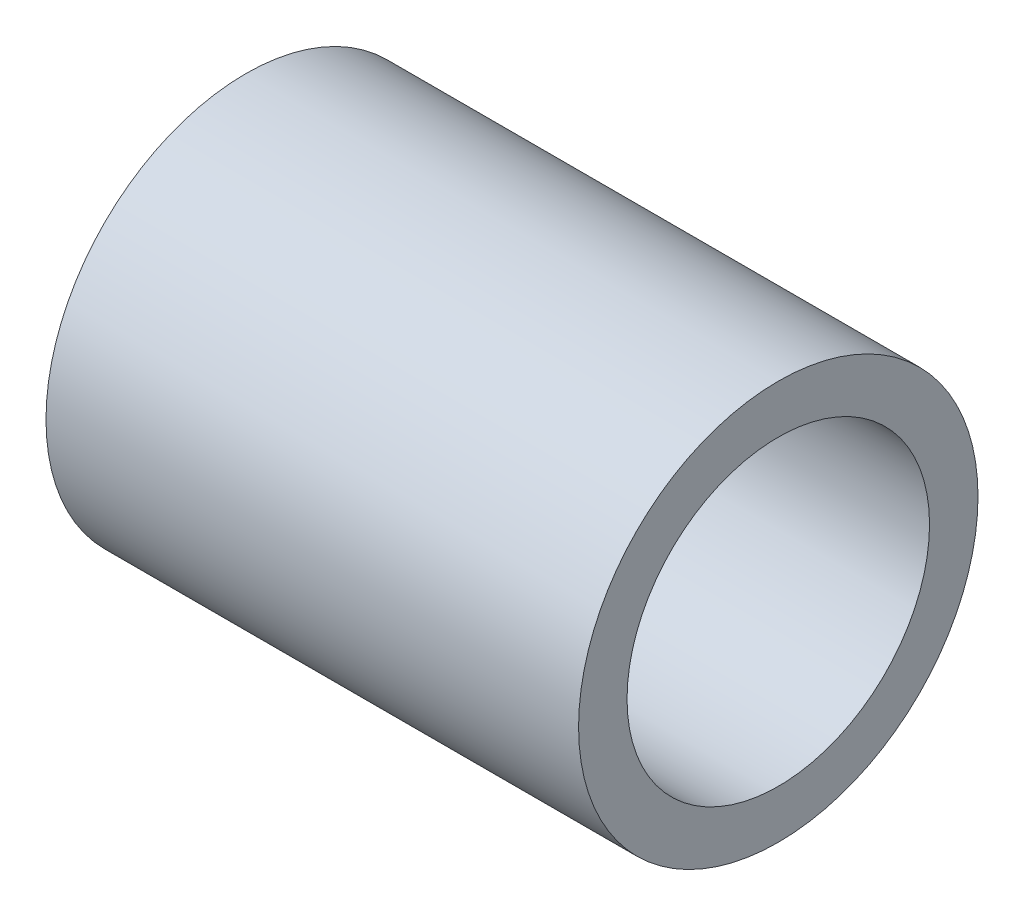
ISO-10303-21;
HEADER;
FILE_DESCRIPTION(('STEP AP214'),'2;1');
FILE_NAME('part.step','',(''),(''),'','','');
FILE_SCHEMA(('AUTOMOTIVE_DESIGN { 1 0 10303 214 1 1 1 1 }'));
ENDSEC;
DATA;
#1=APPLICATION_CONTEXT('core data for automotive mechanical design processes');
#2=APPLICATION_PROTOCOL_DEFINITION('international standard','automotive_design',2000,#1);
#3=PRODUCT_CONTEXT('',#1,'mechanical');
#4=PRODUCT('Part','Part','',(#3));
#5=PRODUCT_RELATED_PRODUCT_CATEGORY('part','',(#4));
#6=PRODUCT_DEFINITION_FORMATION('','',#4);
#7=PRODUCT_DEFINITION_CONTEXT('part definition',#1,'design');
#8=PRODUCT_DEFINITION('design','',#6,#7);
#9=PRODUCT_DEFINITION_SHAPE('','',#8);
#10=(LENGTH_UNIT() NAMED_UNIT(*) SI_UNIT(.MILLI.,.METRE.));
#11=(NAMED_UNIT(*) PLANE_ANGLE_UNIT() SI_UNIT($,.RADIAN.));
#12=(NAMED_UNIT(*) SI_UNIT($,.STERADIAN.) SOLID_ANGLE_UNIT());
#13=UNCERTAINTY_MEASURE_WITH_UNIT(LENGTH_MEASURE(1.E-05),#10,'distance_accuracy_value','');
#14=(GEOMETRIC_REPRESENTATION_CONTEXT(3) GLOBAL_UNCERTAINTY_ASSIGNED_CONTEXT((#13)) GLOBAL_UNIT_ASSIGNED_CONTEXT((#10,
#11,#12)) REPRESENTATION_CONTEXT('',''));
#15=CARTESIAN_POINT('',(0.,0.,0.));
#16=DIRECTION('',(0.,0.,1.));
#17=DIRECTION('',(1.,0.,0.));
#18=AXIS2_PLACEMENT_3D('',#15,#16,#17);
#19=CARTESIAN_POINT('',(22.225,0.,0.));
#20=DIRECTION('',(1.,0.,0.));
#21=DIRECTION('',(0.,0.,1.));
#22=AXIS2_PLACEMENT_3D('',#19,#20,#21);
#23=PLANE('',#22);
#24=CARTESIAN_POINT('',(22.225,0.,0.));
#25=DIRECTION('',(-1.,0.,0.));
#26=DIRECTION('',(0.,0.,1.));
#27=AXIS2_PLACEMENT_3D('',#24,#25,#26);
#28=CIRCLE('',#27,10.8204);
#29=CARTESIAN_POINT('',(22.225,0.,10.8204));
#30=VERTEX_POINT('',#29);
#31=EDGE_CURVE('E55',#30,#30,#28,.T.);
#32=ORIENTED_EDGE('',*,*,#31,.F.);
#33=EDGE_LOOP('',(#32));
#34=FACE_BOUND('',#33,.T.);
#35=CARTESIAN_POINT('',(22.225,0.,0.));
#36=DIRECTION('',(-1.,0.,0.));
#37=DIRECTION('',(0.,0.,1.));
#38=AXIS2_PLACEMENT_3D('',#35,#36,#37);
#39=CIRCLE('',#38,9.2456);
#40=CARTESIAN_POINT('',(22.225,0.,9.2456));
#41=VERTEX_POINT('',#40);
#42=EDGE_CURVE('E59',#41,#41,#39,.T.);
#43=ORIENTED_EDGE('',*,*,#42,.T.);
#44=EDGE_LOOP('',(#43));
#45=FACE_BOUND('',#44,.T.);
#46=ADVANCED_FACE('F32',(#34,#45),#23,.T.);
#47=CARTESIAN_POINT('',(38.1,0.,0.));
#48=DIRECTION('',(-1.,0.,0.));
#49=DIRECTION('',(0.,0.,-1.));
#50=AXIS2_PLACEMENT_3D('',#47,#48,#49);
#51=PLANE('',#50);
#52=CARTESIAN_POINT('',(38.1,0.,0.));
#53=DIRECTION('',(1.,0.,0.));
#54=DIRECTION('',(0.,0.,-1.));
#55=AXIS2_PLACEMENT_3D('',#52,#53,#54);
#56=CIRCLE('',#55,14.2875);
#57=CARTESIAN_POINT('',(38.1,0.,14.2875));
#58=VERTEX_POINT('',#57);
#59=EDGE_CURVE('E52',#58,#58,#56,.T.);
#60=ORIENTED_EDGE('',*,*,#59,.T.);
#61=EDGE_LOOP('',(#60));
#62=FACE_BOUND('',#61,.T.);
#63=CARTESIAN_POINT('',(38.1,0.,0.));
#64=DIRECTION('',(-1.,0.,0.));
#65=DIRECTION('',(0.,0.,1.));
#66=AXIS2_PLACEMENT_3D('',#63,#64,#65);
#67=CIRCLE('',#66,10.8204);
#68=CARTESIAN_POINT('',(38.1,0.,10.8204));
#69=VERTEX_POINT('',#68);
#70=EDGE_CURVE('E56',#69,#69,#67,.T.);
#71=ORIENTED_EDGE('',*,*,#70,.T.);
#72=EDGE_LOOP('',(#71));
#73=FACE_BOUND('',#72,.T.);
#74=ADVANCED_FACE('F83',(#62,#73),#51,.F.);
#75=CARTESIAN_POINT('',(19.05,0.,0.));
#76=DIRECTION('',(-1.,0.,0.));
#77=DIRECTION('',(0.,0.,1.));
#78=AXIS2_PLACEMENT_3D('',#75,#76,#77);
#79=CYLINDRICAL_SURFACE('',#78,14.2875);
#80=CARTESIAN_POINT('',(0.,0.,0.));
#81=DIRECTION('',(1.,0.,0.));
#82=DIRECTION('',(0.,0.,-1.));
#83=AXIS2_PLACEMENT_3D('',#80,#81,#82);
#84=CIRCLE('',#83,14.2875);
#85=CARTESIAN_POINT('',(0.,0.,14.2875));
#86=VERTEX_POINT('',#85);
#87=EDGE_CURVE('E10',#86,#86,#84,.T.);
#88=CARTESIAN_POINT('',(0.,0.,14.2875));
#89=CARTESIAN_POINT('',(0.396875,0.,14.2875));
#90=CARTESIAN_POINT('',(0.79375,0.,14.2875));
#91=CARTESIAN_POINT('',(1.5875,0.,14.2875));
#92=CARTESIAN_POINT('',(1.984375,0.,14.2875));
#93=CARTESIAN_POINT('',(2.778125,0.,14.2875));
#94=CARTESIAN_POINT('',(3.175,0.,14.2875));
#95=CARTESIAN_POINT('',(3.96875,0.,14.2875));
#96=CARTESIAN_POINT('',(4.365625,0.,14.2875));
#97=CARTESIAN_POINT('',(5.159375,0.,14.2875));
#98=CARTESIAN_POINT('',(5.55625,0.,14.2875));
#99=CARTESIAN_POINT('',(6.35,0.,14.2875));
#100=CARTESIAN_POINT('',(6.746875,0.,14.2875));
#101=CARTESIAN_POINT('',(7.540625,0.,14.2875));
#102=CARTESIAN_POINT('',(7.9375,0.,14.2875));
#103=CARTESIAN_POINT('',(8.73125,0.,14.2875));
#104=CARTESIAN_POINT('',(9.128125,0.,14.2875));
#105=CARTESIAN_POINT('',(9.921875,0.,14.2875));
#106=CARTESIAN_POINT('',(10.31875,0.,14.2875));
#107=CARTESIAN_POINT('',(11.1125,0.,14.2875));
#108=CARTESIAN_POINT('',(11.509375,0.,14.2875));
#109=CARTESIAN_POINT('',(12.303125,0.,14.2875));
#110=CARTESIAN_POINT('',(12.7,0.,14.2875));
#111=CARTESIAN_POINT('',(13.49375,0.,14.2875));
#112=CARTESIAN_POINT('',(13.890625,0.,14.2875));
#113=CARTESIAN_POINT('',(14.684375,0.,14.2875));
#114=CARTESIAN_POINT('',(15.08125,0.,14.2875));
#115=CARTESIAN_POINT('',(15.875,0.,14.2875));
#116=CARTESIAN_POINT('',(16.271875,0.,14.2875));
#117=CARTESIAN_POINT('',(17.065625,0.,14.2875));
#118=CARTESIAN_POINT('',(17.4625,0.,14.2875));
#119=CARTESIAN_POINT('',(18.25625,0.,14.2875));
#120=CARTESIAN_POINT('',(18.653125,0.,14.2875));
#121=CARTESIAN_POINT('',(19.446875,0.,14.2875));
#122=CARTESIAN_POINT('',(19.84375,0.,14.2875));
#123=CARTESIAN_POINT('',(20.6375,0.,14.2875));
#124=CARTESIAN_POINT('',(21.034375,0.,14.2875));
#125=CARTESIAN_POINT('',(21.828125,0.,14.2875));
#126=CARTESIAN_POINT('',(22.225,0.,14.2875));
#127=CARTESIAN_POINT('',(23.01875,0.,14.2875));
#128=CARTESIAN_POINT('',(23.415625,0.,14.2875));
#129=CARTESIAN_POINT('',(24.209375,0.,14.2875));
#130=CARTESIAN_POINT('',(24.60625,0.,14.2875));
#131=CARTESIAN_POINT('',(25.4,0.,14.2875));
#132=CARTESIAN_POINT('',(25.796875,0.,14.2875));
#133=CARTESIAN_POINT('',(26.590625,0.,14.2875));
#134=CARTESIAN_POINT('',(26.9875,0.,14.2875));
#135=CARTESIAN_POINT('',(27.78125,0.,14.2875));
#136=CARTESIAN_POINT('',(28.178125,0.,14.2875));
#137=CARTESIAN_POINT('',(28.971875,0.,14.2875));
#138=CARTESIAN_POINT('',(29.36875,0.,14.2875));
#139=CARTESIAN_POINT('',(30.1625,0.,14.2875));
#140=CARTESIAN_POINT('',(30.559375,0.,14.2875));
#141=CARTESIAN_POINT('',(31.353125,0.,14.2875));
#142=CARTESIAN_POINT('',(31.75,0.,14.2875));
#143=CARTESIAN_POINT('',(32.54375,0.,14.2875));
#144=CARTESIAN_POINT('',(32.940625,0.,14.2875));
#145=CARTESIAN_POINT('',(33.734375,0.,14.2875));
#146=CARTESIAN_POINT('',(34.13125,0.,14.2875));
#147=CARTESIAN_POINT('',(34.925,0.,14.2875));
#148=CARTESIAN_POINT('',(35.321875,0.,14.2875));
#149=CARTESIAN_POINT('',(36.115625,0.,14.2875));
#150=CARTESIAN_POINT('',(36.5125,0.,14.2875));
#151=CARTESIAN_POINT('',(37.30625,0.,14.2875));
#152=CARTESIAN_POINT('',(37.703125,0.,14.2875));
#153=CARTESIAN_POINT('',(38.1,0.,14.2875));
#154=B_SPLINE_CURVE_WITH_KNOTS('',3,(#88,#89,#90,#91,#92,#93,#94,#95,#96,#97,#98,#99,#100,#101,
#102,#103,#104,#105,#106,#107,#108,#109,#110,#111,#112,#113,#114,#115,#116,#117,#118,#119,#120,
#121,#122,#123,#124,#125,#126,#127,#128,#129,#130,#131,#132,#133,#134,#135,#136,#137,#138,#139,
#140,#141,#142,#143,#144,#145,#146,#147,#148,#149,#150,#151,#152,#153),.UNSPECIFIED.,.F.,.F.,(4,
2,2,2,2,2,2,2,2,2,2,2,2,2,2,2,2,2,2,2,2,2,2,2,2,2,2,2,2,2,2,2,4),(0.,1.190625,2.38125,3.571875,
4.7625,5.953125,7.14375,8.334375,9.525,10.715625,11.90625,13.096875,14.2875,15.478125,16.66875,
17.859375,19.05,20.240625,21.43125,22.621875,23.8125,25.003125,26.19375,27.384375,28.575,
29.765625,30.95625,32.146875,33.3375,34.528125,35.71875,36.909375,38.1),.UNSPECIFIED.);
#155=EDGE_CURVE('BSEAM34',#86,#58,#154,.T.);
#156=ORIENTED_EDGE('',*,*,#87,.T.);
#157=ORIENTED_EDGE('',*,*,#59,.F.);
#158=ORIENTED_EDGE('',*,*,#155,.T.);
#159=ORIENTED_EDGE('',*,*,#155,.F.);
#160=EDGE_LOOP('',(#156,#158,#157,#159));
#161=FACE_BOUND('',#160,.T.);
#162=ADVANCED_FACE('F34',(#161),#79,.T.);
#163=CARTESIAN_POINT('',(0.,0.,0.));
#164=DIRECTION('',(1.,0.,0.));
#165=DIRECTION('',(0.,0.,-1.));
#166=AXIS2_PLACEMENT_3D('',#163,#164,#165);
#167=PLANE('',#166);
#168=CARTESIAN_POINT('',(0.,0.,0.));
#169=DIRECTION('',(-1.,0.,0.));
#170=DIRECTION('',(0.,0.,1.));
#171=AXIS2_PLACEMENT_3D('',#168,#169,#170);
#172=CIRCLE('',#171,10.8204);
#173=CARTESIAN_POINT('',(0.,0.,10.8204));
#174=VERTEX_POINT('',#173);
#175=EDGE_CURVE('E43',#174,#174,#172,.T.);
#176=ORIENTED_EDGE('',*,*,#175,.F.);
#177=EDGE_LOOP('',(#176));
#178=FACE_BOUND('',#177,.T.);
#179=ORIENTED_EDGE('',*,*,#87,.F.);
#180=EDGE_LOOP('',(#179));
#181=FACE_BOUND('',#180,.T.);
#182=ADVANCED_FACE('F97',(#178,#181),#167,.F.);
#183=CARTESIAN_POINT('',(15.875,0.,0.));
#184=DIRECTION('',(-1.,0.,0.));
#185=DIRECTION('',(0.,0.,1.));
#186=AXIS2_PLACEMENT_3D('',#183,#184,#185);
#187=CYLINDRICAL_SURFACE('',#186,10.8204);
#188=CARTESIAN_POINT('',(15.875,0.,0.));
#189=DIRECTION('',(-1.,0.,0.));
#190=DIRECTION('',(0.,0.,1.));
#191=AXIS2_PLACEMENT_3D('',#188,#189,#190);
#192=CIRCLE('',#191,10.8204);
#193=CARTESIAN_POINT('',(15.875,0.,10.8204));
#194=VERTEX_POINT('',#193);
#195=EDGE_CURVE('E39',#194,#194,#192,.T.);
#196=ORIENTED_EDGE('',*,*,#195,.F.);
#197=EDGE_LOOP('',(#196));
#198=FACE_BOUND('',#197,.T.);
#199=ORIENTED_EDGE('',*,*,#175,.T.);
#200=EDGE_LOOP('',(#199));
#201=FACE_BOUND('',#200,.T.);
#202=ADVANCED_FACE('F78',(#198,#201),#187,.F.);
#203=CARTESIAN_POINT('',(15.875,0.,0.));
#204=DIRECTION('',(-1.,0.,0.));
#205=DIRECTION('',(0.,0.,1.));
#206=AXIS2_PLACEMENT_3D('',#203,#204,#205);
#207=PLANE('',#206);
#208=CARTESIAN_POINT('',(15.875,0.,0.));
#209=DIRECTION('',(-1.,0.,0.));
#210=DIRECTION('',(0.,0.,1.));
#211=AXIS2_PLACEMENT_3D('',#208,#209,#210);
#212=CIRCLE('',#211,9.2456);
#213=CARTESIAN_POINT('',(15.875,0.,9.2456));
#214=VERTEX_POINT('',#213);
#215=EDGE_CURVE('E48',#214,#214,#212,.T.);
#216=ORIENTED_EDGE('',*,*,#215,.F.);
#217=EDGE_LOOP('',(#216));
#218=FACE_BOUND('',#217,.T.);
#219=ORIENTED_EDGE('',*,*,#195,.T.);
#220=EDGE_LOOP('',(#219));
#221=FACE_BOUND('',#220,.T.);
#222=ADVANCED_FACE('F69',(#218,#221),#207,.T.);
#223=CARTESIAN_POINT('',(19.05,0.,0.));
#224=DIRECTION('',(-1.,0.,0.));
#225=DIRECTION('',(0.,0.,1.));
#226=AXIS2_PLACEMENT_3D('',#223,#224,#225);
#227=CYLINDRICAL_SURFACE('',#226,9.2456);
#228=ORIENTED_EDGE('',*,*,#215,.T.);
#229=EDGE_LOOP('',(#228));
#230=FACE_BOUND('',#229,.T.);
#231=ORIENTED_EDGE('',*,*,#42,.F.);
#232=EDGE_LOOP('',(#231));
#233=FACE_BOUND('',#232,.T.);
#234=ADVANCED_FACE('F66',(#230,#233),#227,.F.);
#235=CARTESIAN_POINT('',(22.225,0.,0.));
#236=DIRECTION('',(1.,0.,0.));
#237=DIRECTION('',(0.,0.,-1.));
#238=AXIS2_PLACEMENT_3D('',#235,#236,#237);
#239=CYLINDRICAL_SURFACE('',#238,10.8204);
#240=ORIENTED_EDGE('',*,*,#31,.T.);
#241=EDGE_LOOP('',(#240));
#242=FACE_BOUND('',#241,.T.);
#243=ORIENTED_EDGE('',*,*,#70,.F.);
#244=EDGE_LOOP('',(#243));
#245=FACE_BOUND('',#244,.T.);
#246=ADVANCED_FACE('F68',(#242,#245),#239,.F.);
#247=CLOSED_SHELL('',(#46,#74,#162,#182,#202,#222,#234,#246));
#248=MANIFOLD_SOLID_BREP('B2',#247);
#249=ADVANCED_BREP_SHAPE_REPRESENTATION('',(#18,#248),#14);
#250=SHAPE_DEFINITION_REPRESENTATION(#9,#249);
ENDSEC;
END-ISO-10303-21;
